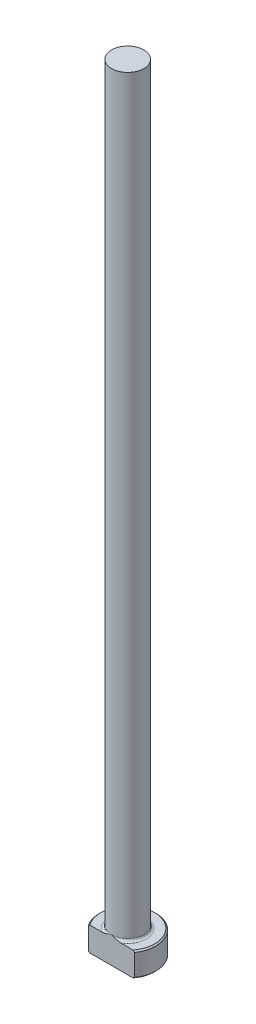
from build123d import *

# Parameters (mm, degrees)
CHAMFER1_SIZE = 0.254
FILLET1_R     = 0.508
KEY_DEPTH     = 153.60197502


with BuildPart() as part:
    # Sketch1 → Revolve1 (revolve)
    with BuildSketch(Plane.XY, mode=Mode.PRIVATE) as revolve1_sk:
        Polygon((0, 0), (-5.5499, 0), (-5.5499, 4.7498), (-3.175, 4.7498), (-3.175, 152.4), (0, 152.4), align=None)
    revolve(revolve1_sk.sketch.rotate(Axis((0, 259.958771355, 0), (0, -1, 0)), 270), axis=Axis((0, 259.958771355, 0), (0, -1, 0)))

    # Chamfer1
    chamfer1_edges = [part.edges().sort_by_distance(p)[0] for p in [
        (0, 4.7498, -5.5499),
        (0, 0, -5.5499),
    ]]
    chamfer(chamfer1_edges, length=CHAMFER1_SIZE)

    # Fillet1
    fillet1_edges = [part.edges().sort_by_distance(p)[0] for p in [
        (0, 4.7498, -3.175),
    ]]
    fillet(fillet1_edges, radius=FILLET1_R)

    # Sketch2 → KEY (cut, through all)
    with BuildSketch(Plane.XZ):
        with BuildLine():
            Line((-4.552006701, 3.175), (4.552006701, 3.175))
            ThreePointArc((4.552006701, 3.175), (0, 5.5499), (-4.552006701, 3.175))
        make_face()
    extrude(amount=-KEY_DEPTH, mode=Mode.SUBTRACT)


solid = part.part
